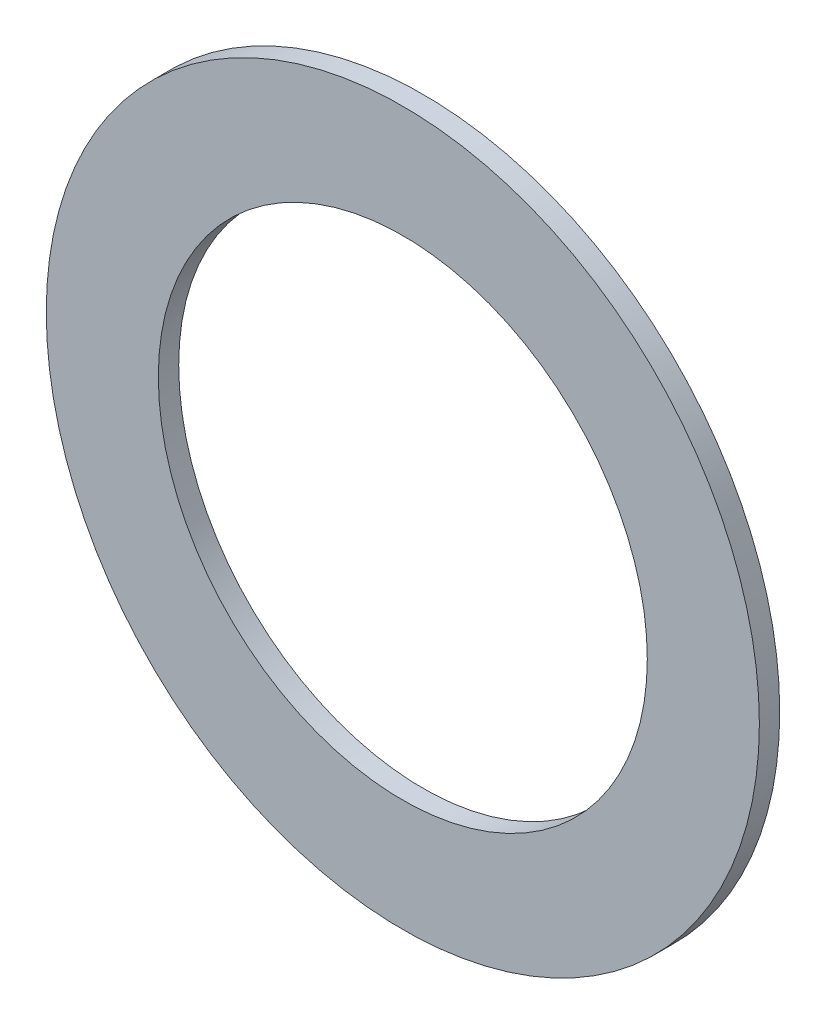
ISO-10303-21;
HEADER;
FILE_DESCRIPTION(('STEP AP214'),'2;1');
FILE_NAME('part.step','',(''),(''),'','','');
FILE_SCHEMA(('AUTOMOTIVE_DESIGN { 1 0 10303 214 1 1 1 1 }'));
ENDSEC;
DATA;
#1=APPLICATION_CONTEXT('core data for automotive mechanical design processes');
#2=APPLICATION_PROTOCOL_DEFINITION('international standard','automotive_design',2000,#1);
#3=PRODUCT_CONTEXT('',#1,'mechanical');
#4=PRODUCT('Part','Part','',(#3));
#5=PRODUCT_RELATED_PRODUCT_CATEGORY('part','',(#4));
#6=PRODUCT_DEFINITION_FORMATION('','',#4);
#7=PRODUCT_DEFINITION_CONTEXT('part definition',#1,'design');
#8=PRODUCT_DEFINITION('design','',#6,#7);
#9=PRODUCT_DEFINITION_SHAPE('','',#8);
#10=(LENGTH_UNIT() NAMED_UNIT(*) SI_UNIT(.MILLI.,.METRE.));
#11=(NAMED_UNIT(*) PLANE_ANGLE_UNIT() SI_UNIT($,.RADIAN.));
#12=(NAMED_UNIT(*) SI_UNIT($,.STERADIAN.) SOLID_ANGLE_UNIT());
#13=UNCERTAINTY_MEASURE_WITH_UNIT(LENGTH_MEASURE(1.E-05),#10,'distance_accuracy_value','');
#14=(GEOMETRIC_REPRESENTATION_CONTEXT(3) GLOBAL_UNCERTAINTY_ASSIGNED_CONTEXT((#13)) GLOBAL_UNIT_ASSIGNED_CONTEXT((#10,
#11,#12)) REPRESENTATION_CONTEXT('',''));
#15=CARTESIAN_POINT('',(0.,0.,0.));
#16=DIRECTION('',(0.,0.,1.));
#17=DIRECTION('',(1.,0.,0.));
#18=AXIS2_PLACEMENT_3D('',#15,#16,#17);
#19=CARTESIAN_POINT('',(0.,0.,2.));
#20=DIRECTION('',(0.,0.,-1.));
#21=DIRECTION('',(-1.,0.,0.));
#22=AXIS2_PLACEMENT_3D('',#19,#20,#21);
#23=CYLINDRICAL_SURFACE('',#22,35.);
#24=CARTESIAN_POINT('',(0.,0.,0.));
#25=DIRECTION('',(0.,0.,-1.));
#26=DIRECTION('',(-1.,0.,0.));
#27=AXIS2_PLACEMENT_3D('',#24,#25,#26);
#28=CIRCLE('',#27,35.);
#29=CARTESIAN_POINT('',(-35.,0.,0.));
#30=VERTEX_POINT('',#29);
#31=EDGE_CURVE('E34',#30,#30,#28,.F.);
#32=ORIENTED_EDGE('',*,*,#31,.T.);
#33=EDGE_LOOP('',(#32));
#34=FACE_BOUND('',#33,.T.);
#35=CARTESIAN_POINT('',(0.,0.,2.));
#36=DIRECTION('',(0.,0.,-1.));
#37=DIRECTION('',(-1.,0.,0.));
#38=AXIS2_PLACEMENT_3D('',#35,#36,#37);
#39=CIRCLE('',#38,35.);
#40=CARTESIAN_POINT('',(-35.,0.,2.));
#41=VERTEX_POINT('',#40);
#42=EDGE_CURVE('E43',#41,#41,#39,.F.);
#43=ORIENTED_EDGE('',*,*,#42,.F.);
#44=EDGE_LOOP('',(#43));
#45=FACE_BOUND('',#44,.T.);
#46=ADVANCED_FACE('F30',(#34,#45),#23,.T.);
#47=CARTESIAN_POINT('',(-35.42,-35.541879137,0.));
#48=DIRECTION('',(0.,0.,1.));
#49=DIRECTION('',(1.,0.,0.));
#50=AXIS2_PLACEMENT_3D('',#47,#48,#49);
#51=PLANE('',#50);
#52=CARTESIAN_POINT('',(0.,0.,0.));
#53=DIRECTION('',(0.,0.,-1.));
#54=DIRECTION('',(-1.,0.,0.));
#55=AXIS2_PLACEMENT_3D('',#52,#53,#54);
#56=CIRCLE('',#55,24.);
#57=CARTESIAN_POINT('',(-24.,0.,0.));
#58=VERTEX_POINT('',#57);
#59=EDGE_CURVE('E38',#58,#58,#56,.F.);
#60=ORIENTED_EDGE('',*,*,#59,.T.);
#61=EDGE_LOOP('',(#60));
#62=FACE_BOUND('',#61,.T.);
#63=ORIENTED_EDGE('',*,*,#31,.F.);
#64=EDGE_LOOP('',(#63));
#65=FACE_BOUND('',#64,.T.);
#66=ADVANCED_FACE('F53',(#62,#65),#51,.F.);
#67=CARTESIAN_POINT('',(-35.42,-35.541879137,2.));
#68=DIRECTION('',(0.,0.,1.));
#69=DIRECTION('',(1.,0.,0.));
#70=AXIS2_PLACEMENT_3D('',#67,#68,#69);
#71=PLANE('',#70);
#72=CARTESIAN_POINT('',(0.,0.,2.));
#73=DIRECTION('',(0.,0.,-1.));
#74=DIRECTION('',(-1.,0.,0.));
#75=AXIS2_PLACEMENT_3D('',#72,#73,#74);
#76=CIRCLE('',#75,24.);
#77=CARTESIAN_POINT('',(-24.,0.,2.));
#78=VERTEX_POINT('',#77);
#79=EDGE_CURVE('E10',#78,#78,#76,.T.);
#80=ORIENTED_EDGE('',*,*,#79,.T.);
#81=EDGE_LOOP('',(#80));
#82=FACE_BOUND('',#81,.T.);
#83=ORIENTED_EDGE('',*,*,#42,.T.);
#84=EDGE_LOOP('',(#83));
#85=FACE_BOUND('',#84,.T.);
#86=ADVANCED_FACE('F32',(#82,#85),#71,.T.);
#87=CARTESIAN_POINT('',(0.,0.,2.));
#88=DIRECTION('',(0.,0.,-1.));
#89=DIRECTION('',(-1.,0.,0.));
#90=AXIS2_PLACEMENT_3D('',#87,#88,#89);
#91=CYLINDRICAL_SURFACE('',#90,24.);
#92=ORIENTED_EDGE('',*,*,#59,.F.);
#93=EDGE_LOOP('',(#92));
#94=FACE_BOUND('',#93,.T.);
#95=ORIENTED_EDGE('',*,*,#79,.F.);
#96=EDGE_LOOP('',(#95));
#97=FACE_BOUND('',#96,.T.);
#98=ADVANCED_FACE('F60',(#94,#97),#91,.F.);
#99=CLOSED_SHELL('',(#46,#66,#86,#98));
#100=MANIFOLD_SOLID_BREP('B2',#99);
#101=ADVANCED_BREP_SHAPE_REPRESENTATION('',(#18,#100),#14);
#102=SHAPE_DEFINITION_REPRESENTATION(#9,#101);
ENDSEC;
END-ISO-10303-21;
